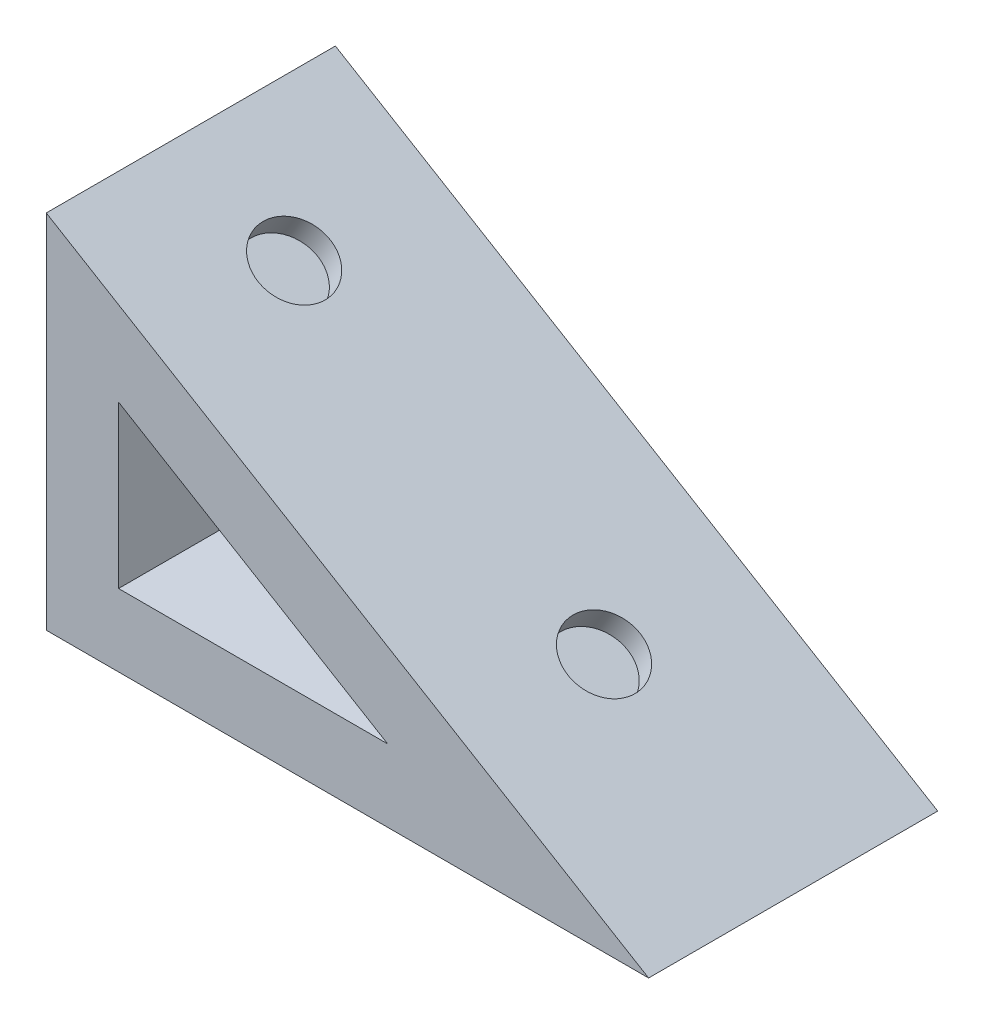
from build123d import *

# Parameters (mm, degrees)
BOSS_EXTRUDE1_DEPTH = 12
SKETCH2_R           = 2
SKETCH2_R_2         = 1
CUT_EXTRUDE1_DEPTH  = 2
SKETCH3_R           = 1.5
CUT_EXTRUDE2_DEPTH  = 1
CUT_EXTRUDE3_DEPTH  = 10


with BuildPart() as part:
    # Sketch1 → Boss-Extrude1 (new body)
    with BuildSketch(Plane.XY):
        Polygon((0, 0), (25, 0), (0, 15), align=None)
    extrude(amount=BOSS_EXTRUDE1_DEPTH)

    # Sketch2 → Cut-Extrude1 (cut)
    with BuildSketch(Plane.XZ):
        with Locations(Location((3, 6, 0), (0, 0, 270))):
            Circle(SKETCH2_R)
        with Locations(Location((18, 6, 0), (0, 0, 270))):
            Circle(SKETCH2_R_2)
    extrude(amount=-CUT_EXTRUDE1_DEPTH, mode=Mode.SUBTRACT)

    # Sketch3 → Cut-Extrude2 (cut)
    with BuildSketch(Plane(origin=(6.617647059, 11.029411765, 0), x_dir=(0.8574929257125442, -0.5144957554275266, 0), z_dir=(0.5144957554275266, 0.8574929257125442, 0))):
        with Locations(Location((12.282563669, -6, 0), (0, 0, 180))):
            Circle(SKETCH3_R)
        with Locations(Location((-2.717436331, -6, 0), (0, 0, 180))):
            Circle(SKETCH3_R)
    extrude(amount=-CUT_EXTRUDE2_DEPTH, mode=Mode.SUBTRACT)

    # Sketch4 → Cut-Extrude3 (cut)
    with BuildSketch(Plane.XY.offset(12)):
        Polygon((3, 9.701428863), (3, 3), (14.169048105, 3), align=None)
    extrude(amount=-CUT_EXTRUDE3_DEPTH, mode=Mode.SUBTRACT)


solid = part.part
